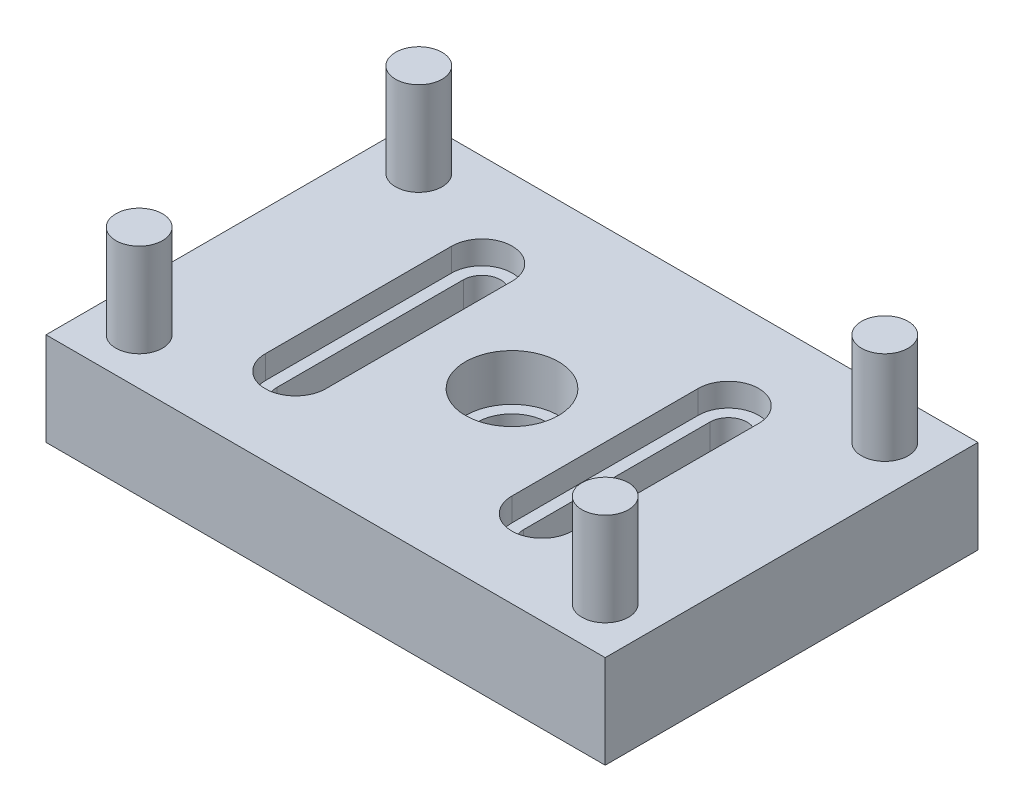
ISO-10303-21;
HEADER;
FILE_DESCRIPTION(('STEP AP214'),'2;1');
FILE_NAME('part.step','',(''),(''),'','','');
FILE_SCHEMA(('AUTOMOTIVE_DESIGN { 1 0 10303 214 1 1 1 1 }'));
ENDSEC;
DATA;
#1=APPLICATION_CONTEXT('core data for automotive mechanical design processes');
#2=APPLICATION_PROTOCOL_DEFINITION('international standard','automotive_design',2000,#1);
#3=PRODUCT_CONTEXT('',#1,'mechanical');
#4=PRODUCT('Part','Part','',(#3));
#5=PRODUCT_RELATED_PRODUCT_CATEGORY('part','',(#4));
#6=PRODUCT_DEFINITION_FORMATION('','',#4);
#7=PRODUCT_DEFINITION_CONTEXT('part definition',#1,'design');
#8=PRODUCT_DEFINITION('design','',#6,#7);
#9=PRODUCT_DEFINITION_SHAPE('','',#8);
#10=(LENGTH_UNIT() NAMED_UNIT(*) SI_UNIT(.MILLI.,.METRE.));
#11=(NAMED_UNIT(*) PLANE_ANGLE_UNIT() SI_UNIT($,.RADIAN.));
#12=(NAMED_UNIT(*) SI_UNIT($,.STERADIAN.) SOLID_ANGLE_UNIT());
#13=UNCERTAINTY_MEASURE_WITH_UNIT(LENGTH_MEASURE(1.E-05),#10,'distance_accuracy_value','');
#14=(GEOMETRIC_REPRESENTATION_CONTEXT(3) GLOBAL_UNCERTAINTY_ASSIGNED_CONTEXT((#13)) GLOBAL_UNIT_ASSIGNED_CONTEXT((#10,
#11,#12)) REPRESENTATION_CONTEXT('',''));
#15=CARTESIAN_POINT('',(0.,0.,0.));
#16=DIRECTION('',(0.,0.,1.));
#17=DIRECTION('',(1.,0.,0.));
#18=AXIS2_PLACEMENT_3D('',#15,#16,#17);
#19=CARTESIAN_POINT('',(0.,-25.4,0.));
#20=DIRECTION('',(0.,1.,0.));
#21=DIRECTION('',(0.,0.,1.));
#22=AXIS2_PLACEMENT_3D('',#19,#20,#21);
#23=CYLINDRICAL_SURFACE('',#22,9.525);
#24=CARTESIAN_POINT('',(0.,-25.4,0.));
#25=DIRECTION('',(0.,1.,0.));
#26=DIRECTION('',(0.,0.,1.));
#27=AXIS2_PLACEMENT_3D('',#24,#25,#26);
#28=CIRCLE('',#27,9.525);
#29=CARTESIAN_POINT('',(0.,-25.4,9.525));
#30=VERTEX_POINT('',#29);
#31=EDGE_CURVE('E408',#30,#30,#28,.T.);
#32=ORIENTED_EDGE('',*,*,#31,.F.);
#33=EDGE_LOOP('',(#32));
#34=FACE_BOUND('',#33,.T.);
#35=CARTESIAN_POINT('',(0.,-12.7,0.));
#36=DIRECTION('',(0.,1.,0.));
#37=DIRECTION('',(0.,0.,1.));
#38=AXIS2_PLACEMENT_3D('',#35,#36,#37);
#39=CIRCLE('',#38,9.525);
#40=CARTESIAN_POINT('',(0.,-12.7,9.525));
#41=VERTEX_POINT('',#40);
#42=EDGE_CURVE('E404',#41,#41,#39,.T.);
#43=ORIENTED_EDGE('',*,*,#42,.T.);
#44=EDGE_LOOP('',(#43));
#45=FACE_BOUND('',#44,.T.);
#46=ADVANCED_FACE('F33',(#34,#45),#23,.F.);
#47=CARTESIAN_POINT('',(0.,0.,0.));
#48=DIRECTION('',(0.,-1.,0.));
#49=DIRECTION('',(0.,0.,-1.));
#50=AXIS2_PLACEMENT_3D('',#47,#48,#49);
#51=PLANE('',#50);
#52=CARTESIAN_POINT('',(0.,0.,0.));
#53=DIRECTION('',(0.,1.,0.));
#54=DIRECTION('',(0.,0.,1.));
#55=AXIS2_PLACEMENT_3D('',#52,#53,#54);
#56=CIRCLE('',#55,12.7);
#57=CARTESIAN_POINT('',(0.,0.,12.7));
#58=VERTEX_POINT('',#57);
#59=EDGE_CURVE('E413',#58,#58,#56,.T.);
#60=ORIENTED_EDGE('',*,*,#59,.F.);
#61=EDGE_LOOP('',(#60));
#62=FACE_BOUND('',#61,.T.);
#63=CARTESIAN_POINT('',(-63.5,0.,38.1));
#64=DIRECTION('',(0.,-1.,0.));
#65=DIRECTION('',(0.,0.,-1.));
#66=AXIS2_PLACEMENT_3D('',#63,#64,#65);
#67=CIRCLE('',#66,6.35);
#68=CARTESIAN_POINT('',(-63.5,0.,31.75));
#69=VERTEX_POINT('',#68);
#70=EDGE_CURVE('E41',#69,#69,#67,.F.);
#71=ORIENTED_EDGE('',*,*,#70,.F.);
#72=EDGE_LOOP('',(#71));
#73=FACE_BOUND('',#72,.T.);
#74=CARTESIAN_POINT('',(63.5,0.,-38.1));
#75=DIRECTION('',(0.,-1.,0.));
#76=DIRECTION('',(0.,0.,-1.));
#77=AXIS2_PLACEMENT_3D('',#74,#75,#76);
#78=CIRCLE('',#77,6.35);
#79=CARTESIAN_POINT('',(63.5,0.,-44.45));
#80=VERTEX_POINT('',#79);
#81=EDGE_CURVE('E339',#80,#80,#78,.F.);
#82=ORIENTED_EDGE('',*,*,#81,.F.);
#83=EDGE_LOOP('',(#82));
#84=FACE_BOUND('',#83,.T.);
#85=DIRECTION('',(0.,0.,-1.));
#86=VECTOR('',#85,1.);
#87=CARTESIAN_POINT('',(-76.2,0.,50.8));
#88=LINE('',#87,#86);
#89=CARTESIAN_POINT('',(-76.2,0.,50.8));
#90=VERTEX_POINT('',#89);
#91=CARTESIAN_POINT('',(-76.2,0.,-50.8));
#92=VERTEX_POINT('',#91);
#93=EDGE_CURVE('E299',#90,#92,#88,.T.);
#94=ORIENTED_EDGE('',*,*,#93,.F.);
#95=DIRECTION('',(1.,0.,0.));
#96=VECTOR('',#95,1.);
#97=CARTESIAN_POINT('',(-76.2,0.,50.8));
#98=LINE('',#97,#96);
#99=CARTESIAN_POINT('',(76.2,0.,50.8));
#100=VERTEX_POINT('',#99);
#101=EDGE_CURVE('E312',#90,#100,#98,.T.);
#102=ORIENTED_EDGE('',*,*,#101,.T.);
#103=DIRECTION('',(0.,0.,-1.));
#104=VECTOR('',#103,1.);
#105=CARTESIAN_POINT('',(76.2,0.,50.8));
#106=LINE('',#105,#104);
#107=CARTESIAN_POINT('',(76.2,0.,-50.8));
#108=VERTEX_POINT('',#107);
#109=EDGE_CURVE('E326',#100,#108,#106,.T.);
#110=ORIENTED_EDGE('',*,*,#109,.T.);
#111=DIRECTION('',(1.,0.,0.));
#112=VECTOR('',#111,1.);
#113=CARTESIAN_POINT('',(-76.2,0.,-50.8));
#114=LINE('',#113,#112);
#115=EDGE_CURVE('E323',#92,#108,#114,.T.);
#116=ORIENTED_EDGE('',*,*,#115,.F.);
#117=EDGE_LOOP('',(#94,#102,#110,#116));
#118=FACE_BOUND('',#117,.T.);
#119=CARTESIAN_POINT('',(-33.5915,0.,25.4));
#120=DIRECTION('',(0.,1.,0.));
#121=DIRECTION('',(0.,0.,1.));
#122=AXIS2_PLACEMENT_3D('',#119,#120,#121);
#123=CIRCLE('',#122,8.25500000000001);
#124=CARTESIAN_POINT('',(-41.8465,0.,25.4));
#125=VERTEX_POINT('',#124);
#126=CARTESIAN_POINT('',(-25.3365,0.,25.4));
#127=VERTEX_POINT('',#126);
#128=EDGE_CURVE('E245',#125,#127,#123,.T.);
#129=ORIENTED_EDGE('',*,*,#128,.F.);
#130=DIRECTION('',(0.,0.,1.));
#131=VECTOR('',#130,1.);
#132=CARTESIAN_POINT('',(-41.8465,0.,0.));
#133=LINE('',#132,#131);
#134=CARTESIAN_POINT('',(-41.8465,0.,-25.4));
#135=VERTEX_POINT('',#134);
#136=EDGE_CURVE('E216',#135,#125,#133,.T.);
#137=ORIENTED_EDGE('',*,*,#136,.F.);
#138=CARTESIAN_POINT('',(-33.5915,0.,-25.4));
#139=DIRECTION('',(0.,1.,0.));
#140=DIRECTION('',(0.,0.,1.));
#141=AXIS2_PLACEMENT_3D('',#138,#139,#140);
#142=CIRCLE('',#141,8.25500000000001);
#143=CARTESIAN_POINT('',(-25.3365,0.,-25.4));
#144=VERTEX_POINT('',#143);
#145=EDGE_CURVE('E224',#144,#135,#142,.T.);
#146=ORIENTED_EDGE('',*,*,#145,.F.);
#147=DIRECTION('',(0.,0.,1.));
#148=VECTOR('',#147,1.);
#149=CARTESIAN_POINT('',(-25.3365,0.,0.));
#150=LINE('',#149,#148);
#151=EDGE_CURVE('E248',#144,#127,#150,.T.);
#152=ORIENTED_EDGE('',*,*,#151,.T.);
#153=EDGE_LOOP('',(#129,#137,#146,#152));
#154=FACE_BOUND('',#153,.T.);
#155=CARTESIAN_POINT('',(33.5915,0.,25.4));
#156=DIRECTION('',(0.,1.,0.));
#157=DIRECTION('',(0.,0.,1.));
#158=AXIS2_PLACEMENT_3D('',#155,#156,#157);
#159=CIRCLE('',#158,8.25500000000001);
#160=CARTESIAN_POINT('',(41.8465,0.,25.4));
#161=VERTEX_POINT('',#160);
#162=CARTESIAN_POINT('',(25.3365,0.,25.4));
#163=VERTEX_POINT('',#162);
#164=EDGE_CURVE('E48',#161,#163,#159,.F.);
#165=ORIENTED_EDGE('',*,*,#164,.T.);
#166=DIRECTION('',(0.,0.,1.));
#167=VECTOR('',#166,1.);
#168=CARTESIAN_POINT('',(25.3365,0.,0.));
#169=LINE('',#168,#167);
#170=CARTESIAN_POINT('',(25.3365,0.,-25.4));
#171=VERTEX_POINT('',#170);
#172=EDGE_CURVE('E190',#171,#163,#169,.T.);
#173=ORIENTED_EDGE('',*,*,#172,.F.);
#174=CARTESIAN_POINT('',(33.5915,0.,-25.4));
#175=DIRECTION('',(0.,1.,0.));
#176=DIRECTION('',(0.,0.,1.));
#177=AXIS2_PLACEMENT_3D('',#174,#175,#176);
#178=CIRCLE('',#177,8.25500000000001);
#179=CARTESIAN_POINT('',(41.8465,0.,-25.4));
#180=VERTEX_POINT('',#179);
#181=EDGE_CURVE('E193',#171,#180,#178,.F.);
#182=ORIENTED_EDGE('',*,*,#181,.T.);
#183=DIRECTION('',(0.,0.,1.));
#184=VECTOR('',#183,1.);
#185=CARTESIAN_POINT('',(41.8465,0.,0.));
#186=LINE('',#185,#184);
#187=EDGE_CURVE('E210',#180,#161,#186,.T.);
#188=ORIENTED_EDGE('',*,*,#187,.T.);
#189=EDGE_LOOP('',(#165,#173,#182,#188));
#190=FACE_BOUND('',#189,.T.);
#191=CARTESIAN_POINT('',(-63.5,0.,-38.1));
#192=DIRECTION('',(0.,-1.,0.));
#193=DIRECTION('',(0.,0.,-1.));
#194=AXIS2_PLACEMENT_3D('',#191,#192,#193);
#195=CIRCLE('',#194,6.35);
#196=CARTESIAN_POINT('',(-63.5,0.,-44.45));
#197=VERTEX_POINT('',#196);
#198=EDGE_CURVE('E342',#197,#197,#195,.F.);
#199=ORIENTED_EDGE('',*,*,#198,.F.);
#200=EDGE_LOOP('',(#199));
#201=FACE_BOUND('',#200,.T.);
#202=CARTESIAN_POINT('',(63.5,0.,38.1));
#203=DIRECTION('',(0.,-1.,0.));
#204=DIRECTION('',(0.,0.,-1.));
#205=AXIS2_PLACEMENT_3D('',#202,#203,#204);
#206=CIRCLE('',#205,6.35);
#207=CARTESIAN_POINT('',(63.5,0.,31.75));
#208=VERTEX_POINT('',#207);
#209=EDGE_CURVE('E11',#208,#208,#206,.F.);
#210=ORIENTED_EDGE('',*,*,#209,.F.);
#211=EDGE_LOOP('',(#210));
#212=FACE_BOUND('',#211,.T.);
#213=ADVANCED_FACE('F349',(#62,#73,#84,#118,#154,#190,#201,#212),#51,.F.);
#214=CARTESIAN_POINT('',(33.5915,-25.4,-25.4));
#215=DIRECTION('',(0.,1.,0.));
#216=DIRECTION('',(0.,0.,1.));
#217=AXIS2_PLACEMENT_3D('',#214,#215,#216);
#218=CYLINDRICAL_SURFACE('',#217,5.08);
#219=DIRECTION('',(0.,1.,0.));
#220=VECTOR('',#219,1.);
#221=CARTESIAN_POINT('',(38.6715,-25.4,-25.4));
#222=LINE('',#221,#220);
#223=CARTESIAN_POINT('',(38.6715,-25.4,-25.4));
#224=VERTEX_POINT('',#223);
#225=CARTESIAN_POINT('',(38.6715,-6.35,-25.4));
#226=VERTEX_POINT('',#225);
#227=EDGE_CURVE('E272',#224,#226,#222,.T.);
#228=ORIENTED_EDGE('',*,*,#227,.T.);
#229=CARTESIAN_POINT('',(33.5915,-6.35,-25.4));
#230=DIRECTION('',(0.,1.,0.));
#231=DIRECTION('',(0.,0.,1.));
#232=AXIS2_PLACEMENT_3D('',#229,#230,#231);
#233=CIRCLE('',#232,5.08);
#234=CARTESIAN_POINT('',(28.5115,-6.35,-25.4));
#235=VERTEX_POINT('',#234);
#236=EDGE_CURVE('E203',#235,#226,#233,.F.);
#237=ORIENTED_EDGE('',*,*,#236,.F.);
#238=DIRECTION('',(0.,1.,0.));
#239=VECTOR('',#238,1.);
#240=CARTESIAN_POINT('',(28.5115,-25.4,-25.4));
#241=LINE('',#240,#239);
#242=CARTESIAN_POINT('',(28.5115,-25.4,-25.4));
#243=VERTEX_POINT('',#242);
#244=EDGE_CURVE('E271',#243,#235,#241,.T.);
#245=ORIENTED_EDGE('',*,*,#244,.F.);
#246=CARTESIAN_POINT('',(33.5915,-25.4,-25.4));
#247=DIRECTION('',(0.,1.,0.));
#248=DIRECTION('',(0.,0.,1.));
#249=AXIS2_PLACEMENT_3D('',#246,#247,#248);
#250=CIRCLE('',#249,5.08);
#251=EDGE_CURVE('E255',#243,#224,#250,.F.);
#252=ORIENTED_EDGE('',*,*,#251,.T.);
#253=EDGE_LOOP('',(#228,#237,#245,#252));
#254=FACE_BOUND('',#253,.T.);
#255=ADVANCED_FACE('F352',(#254),#218,.F.);
#256=CARTESIAN_POINT('',(38.6715,-25.4,0.));
#257=DIRECTION('',(1.,0.,0.));
#258=DIRECTION('',(0.,0.,-1.));
#259=AXIS2_PLACEMENT_3D('',#256,#257,#258);
#260=PLANE('',#259);
#261=DIRECTION('',(0.,0.,-1.));
#262=VECTOR('',#261,1.);
#263=CARTESIAN_POINT('',(38.6715,-6.35,0.));
#264=LINE('',#263,#262);
#265=CARTESIAN_POINT('',(38.6715,-6.35,25.4));
#266=VERTEX_POINT('',#265);
#267=EDGE_CURVE('E205',#266,#226,#264,.T.);
#268=ORIENTED_EDGE('',*,*,#267,.T.);
#269=ORIENTED_EDGE('',*,*,#227,.F.);
#270=DIRECTION('',(0.,0.,-1.));
#271=VECTOR('',#270,1.);
#272=CARTESIAN_POINT('',(38.6715,-25.4,0.));
#273=LINE('',#272,#271);
#274=CARTESIAN_POINT('',(38.6715,-25.4,25.4));
#275=VERTEX_POINT('',#274);
#276=EDGE_CURVE('E268',#275,#224,#273,.T.);
#277=ORIENTED_EDGE('',*,*,#276,.F.);
#278=DIRECTION('',(0.,1.,0.));
#279=VECTOR('',#278,1.);
#280=CARTESIAN_POINT('',(38.6715,-25.4,25.4));
#281=LINE('',#280,#279);
#282=EDGE_CURVE('E276',#275,#266,#281,.T.);
#283=ORIENTED_EDGE('',*,*,#282,.T.);
#284=EDGE_LOOP('',(#268,#269,#277,#283));
#285=FACE_BOUND('',#284,.T.);
#286=ADVANCED_FACE('F477',(#285),#260,.F.);
#287=CARTESIAN_POINT('',(33.5915,-25.4,25.4));
#288=DIRECTION('',(0.,1.,0.));
#289=DIRECTION('',(0.,0.,1.));
#290=AXIS2_PLACEMENT_3D('',#287,#288,#289);
#291=CYLINDRICAL_SURFACE('',#290,5.08);
#292=DIRECTION('',(0.,1.,0.));
#293=VECTOR('',#292,1.);
#294=CARTESIAN_POINT('',(28.5115,-25.4,25.4));
#295=LINE('',#294,#293);
#296=CARTESIAN_POINT('',(28.5115,-25.4,25.4));
#297=VERTEX_POINT('',#296);
#298=CARTESIAN_POINT('',(28.5115,-6.35,25.4));
#299=VERTEX_POINT('',#298);
#300=EDGE_CURVE('E279',#297,#299,#295,.T.);
#301=ORIENTED_EDGE('',*,*,#300,.T.);
#302=CARTESIAN_POINT('',(33.5915,-6.35,25.4));
#303=DIRECTION('',(0.,1.,0.));
#304=DIRECTION('',(0.,0.,1.));
#305=AXIS2_PLACEMENT_3D('',#302,#303,#304);
#306=CIRCLE('',#305,5.08);
#307=EDGE_CURVE('E56',#266,#299,#306,.F.);
#308=ORIENTED_EDGE('',*,*,#307,.F.);
#309=ORIENTED_EDGE('',*,*,#282,.F.);
#310=CARTESIAN_POINT('',(33.5915,-25.4,25.4));
#311=DIRECTION('',(0.,1.,0.));
#312=DIRECTION('',(0.,0.,1.));
#313=AXIS2_PLACEMENT_3D('',#310,#311,#312);
#314=CIRCLE('',#313,5.08);
#315=EDGE_CURVE('E265',#275,#297,#314,.F.);
#316=ORIENTED_EDGE('',*,*,#315,.T.);
#317=EDGE_LOOP('',(#301,#308,#309,#316));
#318=FACE_BOUND('',#317,.T.);
#319=ADVANCED_FACE('F480',(#318),#291,.F.);
#320=CARTESIAN_POINT('',(28.5115,-25.4,0.));
#321=DIRECTION('',(1.,0.,0.));
#322=DIRECTION('',(0.,0.,-1.));
#323=AXIS2_PLACEMENT_3D('',#320,#321,#322);
#324=PLANE('',#323);
#325=ORIENTED_EDGE('',*,*,#244,.T.);
#326=DIRECTION('',(0.,0.,-1.));
#327=VECTOR('',#326,1.);
#328=CARTESIAN_POINT('',(28.5115,-6.35,0.));
#329=LINE('',#328,#327);
#330=EDGE_CURVE('E201',#299,#235,#329,.T.);
#331=ORIENTED_EDGE('',*,*,#330,.F.);
#332=ORIENTED_EDGE('',*,*,#300,.F.);
#333=DIRECTION('',(0.,0.,-1.));
#334=VECTOR('',#333,1.);
#335=CARTESIAN_POINT('',(28.5115,-25.4,0.));
#336=LINE('',#335,#334);
#337=EDGE_CURVE('E263',#297,#243,#336,.T.);
#338=ORIENTED_EDGE('',*,*,#337,.T.);
#339=EDGE_LOOP('',(#325,#331,#332,#338));
#340=FACE_BOUND('',#339,.T.);
#341=ADVANCED_FACE('F484',(#340),#324,.T.);
#342=CARTESIAN_POINT('',(-28.5115,-25.4,0.));
#343=DIRECTION('',(1.,0.,0.));
#344=DIRECTION('',(0.,0.,-1.));
#345=AXIS2_PLACEMENT_3D('',#342,#343,#344);
#346=PLANE('',#345);
#347=DIRECTION('',(0.,0.,-1.));
#348=VECTOR('',#347,1.);
#349=CARTESIAN_POINT('',(-28.5115,-6.35,0.));
#350=LINE('',#349,#348);
#351=CARTESIAN_POINT('',(-28.5115,-6.35,25.4));
#352=VERTEX_POINT('',#351);
#353=CARTESIAN_POINT('',(-28.5115,-6.35,-25.4));
#354=VERTEX_POINT('',#353);
#355=EDGE_CURVE('E223',#352,#354,#350,.T.);
#356=ORIENTED_EDGE('',*,*,#355,.T.);
#357=DIRECTION('',(0.,1.,0.));
#358=VECTOR('',#357,1.);
#359=CARTESIAN_POINT('',(-28.5115,-25.4,-25.4));
#360=LINE('',#359,#358);
#361=CARTESIAN_POINT('',(-28.5115,-25.4,-25.4));
#362=VERTEX_POINT('',#361);
#363=EDGE_CURVE('E295',#362,#354,#360,.T.);
#364=ORIENTED_EDGE('',*,*,#363,.F.);
#365=DIRECTION('',(0.,0.,-1.));
#366=VECTOR('',#365,1.);
#367=CARTESIAN_POINT('',(-28.5115,-25.4,0.));
#368=LINE('',#367,#366);
#369=CARTESIAN_POINT('',(-28.5115,-25.4,25.4));
#370=VERTEX_POINT('',#369);
#371=EDGE_CURVE('E275',#370,#362,#368,.T.);
#372=ORIENTED_EDGE('',*,*,#371,.F.);
#373=DIRECTION('',(0.,1.,0.));
#374=VECTOR('',#373,1.);
#375=CARTESIAN_POINT('',(-28.5115,-25.4,25.4));
#376=LINE('',#375,#374);
#377=EDGE_CURVE('E296',#370,#352,#376,.T.);
#378=ORIENTED_EDGE('',*,*,#377,.T.);
#379=EDGE_LOOP('',(#356,#364,#372,#378));
#380=FACE_BOUND('',#379,.T.);
#381=ADVANCED_FACE('F488',(#380),#346,.F.);
#382=CARTESIAN_POINT('',(-33.5915,-25.4,25.4));
#383=DIRECTION('',(0.,1.,0.));
#384=DIRECTION('',(0.,0.,1.));
#385=AXIS2_PLACEMENT_3D('',#382,#383,#384);
#386=CYLINDRICAL_SURFACE('',#385,5.08);
#387=CARTESIAN_POINT('',(-33.5915,-6.35,25.4));
#388=DIRECTION('',(0.,1.,0.));
#389=DIRECTION('',(0.,0.,1.));
#390=AXIS2_PLACEMENT_3D('',#387,#388,#389);
#391=CIRCLE('',#390,5.08);
#392=CARTESIAN_POINT('',(-38.6715,-6.35,25.4));
#393=VERTEX_POINT('',#392);
#394=EDGE_CURVE('E227',#393,#352,#391,.T.);
#395=ORIENTED_EDGE('',*,*,#394,.T.);
#396=ORIENTED_EDGE('',*,*,#377,.F.);
#397=CARTESIAN_POINT('',(-33.5915,-25.4,25.4));
#398=DIRECTION('',(0.,1.,0.));
#399=DIRECTION('',(0.,0.,1.));
#400=AXIS2_PLACEMENT_3D('',#397,#398,#399);
#401=CIRCLE('',#400,5.08);
#402=CARTESIAN_POINT('',(-38.6715,-25.4,25.4));
#403=VERTEX_POINT('',#402);
#404=EDGE_CURVE('E292',#403,#370,#401,.T.);
#405=ORIENTED_EDGE('',*,*,#404,.F.);
#406=DIRECTION('',(0.,1.,0.));
#407=VECTOR('',#406,1.);
#408=CARTESIAN_POINT('',(-38.6715,-25.4,25.4));
#409=LINE('',#408,#407);
#410=EDGE_CURVE('E300',#403,#393,#409,.T.);
#411=ORIENTED_EDGE('',*,*,#410,.T.);
#412=EDGE_LOOP('',(#395,#396,#405,#411));
#413=FACE_BOUND('',#412,.T.);
#414=ADVANCED_FACE('F493',(#413),#386,.F.);
#415=CARTESIAN_POINT('',(-38.6715,-25.4,0.));
#416=DIRECTION('',(1.,0.,0.));
#417=DIRECTION('',(0.,0.,-1.));
#418=AXIS2_PLACEMENT_3D('',#415,#416,#417);
#419=PLANE('',#418);
#420=DIRECTION('',(0.,1.,0.));
#421=VECTOR('',#420,1.);
#422=CARTESIAN_POINT('',(-38.6715,-25.4,-25.4));
#423=LINE('',#422,#421);
#424=CARTESIAN_POINT('',(-38.6715,-25.4,-25.4));
#425=VERTEX_POINT('',#424);
#426=CARTESIAN_POINT('',(-38.6715,-6.35,-25.4));
#427=VERTEX_POINT('',#426);
#428=EDGE_CURVE('E303',#425,#427,#423,.T.);
#429=ORIENTED_EDGE('',*,*,#428,.T.);
#430=DIRECTION('',(0.,0.,-1.));
#431=VECTOR('',#430,1.);
#432=CARTESIAN_POINT('',(-38.6715,-6.35,0.));
#433=LINE('',#432,#431);
#434=EDGE_CURVE('E230',#393,#427,#433,.T.);
#435=ORIENTED_EDGE('',*,*,#434,.F.);
#436=ORIENTED_EDGE('',*,*,#410,.F.);
#437=DIRECTION('',(0.,0.,-1.));
#438=VECTOR('',#437,1.);
#439=CARTESIAN_POINT('',(-38.6715,-25.4,0.));
#440=LINE('',#439,#438);
#441=EDGE_CURVE('E289',#403,#425,#440,.T.);
#442=ORIENTED_EDGE('',*,*,#441,.T.);
#443=EDGE_LOOP('',(#429,#435,#436,#442));
#444=FACE_BOUND('',#443,.T.);
#445=ADVANCED_FACE('F496',(#444),#419,.T.);
#446=CARTESIAN_POINT('',(-33.5915,-25.4,-25.4));
#447=DIRECTION('',(0.,1.,0.));
#448=DIRECTION('',(0.,0.,1.));
#449=AXIS2_PLACEMENT_3D('',#446,#447,#448);
#450=CYLINDRICAL_SURFACE('',#449,5.08);
#451=CARTESIAN_POINT('',(-33.5915,-6.35,-25.4));
#452=DIRECTION('',(0.,1.,0.));
#453=DIRECTION('',(0.,0.,1.));
#454=AXIS2_PLACEMENT_3D('',#451,#452,#453);
#455=CIRCLE('',#454,5.08);
#456=EDGE_CURVE('E220',#354,#427,#455,.T.);
#457=ORIENTED_EDGE('',*,*,#456,.T.);
#458=ORIENTED_EDGE('',*,*,#428,.F.);
#459=CARTESIAN_POINT('',(-33.5915,-25.4,-25.4));
#460=DIRECTION('',(0.,1.,0.));
#461=DIRECTION('',(0.,0.,1.));
#462=AXIS2_PLACEMENT_3D('',#459,#460,#461);
#463=CIRCLE('',#462,5.08);
#464=EDGE_CURVE('E286',#362,#425,#463,.T.);
#465=ORIENTED_EDGE('',*,*,#464,.F.);
#466=ORIENTED_EDGE('',*,*,#363,.T.);
#467=EDGE_LOOP('',(#457,#458,#465,#466));
#468=FACE_BOUND('',#467,.T.);
#469=ADVANCED_FACE('F500',(#468),#450,.F.);
#470=CARTESIAN_POINT('',(0.,-25.4,0.));
#471=DIRECTION('',(0.,-1.,0.));
#472=DIRECTION('',(0.,0.,-1.));
#473=AXIS2_PLACEMENT_3D('',#470,#471,#472);
#474=PLANE('',#473);
#475=ORIENTED_EDGE('',*,*,#31,.T.);
#476=EDGE_LOOP('',(#475));
#477=FACE_BOUND('',#476,.T.);
#478=DIRECTION('',(0.,0.,-1.));
#479=VECTOR('',#478,1.);
#480=CARTESIAN_POINT('',(-76.2,-25.4,50.8));
#481=LINE('',#480,#479);
#482=CARTESIAN_POINT('',(-76.2,-25.4,50.8));
#483=VERTEX_POINT('',#482);
#484=CARTESIAN_POINT('',(-76.2,-25.4,-50.8));
#485=VERTEX_POINT('',#484);
#486=EDGE_CURVE('E308',#483,#485,#481,.T.);
#487=ORIENTED_EDGE('',*,*,#486,.T.);
#488=DIRECTION('',(1.,0.,0.));
#489=VECTOR('',#488,1.);
#490=CARTESIAN_POINT('',(-76.2,-25.4,-50.8));
#491=LINE('',#490,#489);
#492=CARTESIAN_POINT('',(76.2,-25.4,-50.8));
#493=VERTEX_POINT('',#492);
#494=EDGE_CURVE('E311',#485,#493,#491,.T.);
#495=ORIENTED_EDGE('',*,*,#494,.T.);
#496=DIRECTION('',(0.,0.,-1.));
#497=VECTOR('',#496,1.);
#498=CARTESIAN_POINT('',(76.2,-25.4,50.8));
#499=LINE('',#498,#497);
#500=CARTESIAN_POINT('',(76.2,-25.4,50.8));
#501=VERTEX_POINT('',#500);
#502=EDGE_CURVE('E314',#501,#493,#499,.T.);
#503=ORIENTED_EDGE('',*,*,#502,.F.);
#504=DIRECTION('',(1.,0.,0.));
#505=VECTOR('',#504,1.);
#506=CARTESIAN_POINT('',(-76.2,-25.4,50.8));
#507=LINE('',#506,#505);
#508=EDGE_CURVE('E317',#483,#501,#507,.T.);
#509=ORIENTED_EDGE('',*,*,#508,.F.);
#510=EDGE_LOOP('',(#487,#495,#503,#509));
#511=FACE_BOUND('',#510,.T.);
#512=ORIENTED_EDGE('',*,*,#371,.T.);
#513=ORIENTED_EDGE('',*,*,#464,.T.);
#514=ORIENTED_EDGE('',*,*,#441,.F.);
#515=ORIENTED_EDGE('',*,*,#404,.T.);
#516=EDGE_LOOP('',(#512,#513,#514,#515));
#517=FACE_BOUND('',#516,.T.);
#518=ORIENTED_EDGE('',*,*,#276,.T.);
#519=ORIENTED_EDGE('',*,*,#251,.F.);
#520=ORIENTED_EDGE('',*,*,#337,.F.);
#521=ORIENTED_EDGE('',*,*,#315,.F.);
#522=EDGE_LOOP('',(#518,#519,#520,#521));
#523=FACE_BOUND('',#522,.T.);
#524=ADVANCED_FACE('F504',(#477,#511,#517,#523),#474,.T.);
#525=CARTESIAN_POINT('',(-76.2,-25.4,50.8));
#526=DIRECTION('',(1.,0.,0.));
#527=DIRECTION('',(0.,0.,-1.));
#528=AXIS2_PLACEMENT_3D('',#525,#526,#527);
#529=PLANE('',#528);
#530=ORIENTED_EDGE('',*,*,#93,.T.);
#531=DIRECTION('',(0.,1.,0.));
#532=VECTOR('',#531,1.);
#533=CARTESIAN_POINT('',(-76.2,-25.4,-50.8));
#534=LINE('',#533,#532);
#535=EDGE_CURVE('E336',#485,#92,#534,.T.);
#536=ORIENTED_EDGE('',*,*,#535,.F.);
#537=ORIENTED_EDGE('',*,*,#486,.F.);
#538=DIRECTION('',(0.,1.,0.));
#539=VECTOR('',#538,1.);
#540=CARTESIAN_POINT('',(-76.2,-25.4,50.8));
#541=LINE('',#540,#539);
#542=EDGE_CURVE('E320',#483,#90,#541,.T.);
#543=ORIENTED_EDGE('',*,*,#542,.T.);
#544=EDGE_LOOP('',(#530,#536,#537,#543));
#545=FACE_BOUND('',#544,.T.);
#546=ADVANCED_FACE('F35',(#545),#529,.F.);
#547=CARTESIAN_POINT('',(-76.2,-25.4,-50.8));
#548=DIRECTION('',(0.,0.,1.));
#549=DIRECTION('',(1.,0.,0.));
#550=AXIS2_PLACEMENT_3D('',#547,#548,#549);
#551=PLANE('',#550);
#552=ORIENTED_EDGE('',*,*,#115,.T.);
#553=DIRECTION('',(0.,1.,0.));
#554=VECTOR('',#553,1.);
#555=CARTESIAN_POINT('',(76.2,-25.4,-50.8));
#556=LINE('',#555,#554);
#557=EDGE_CURVE('E334',#493,#108,#556,.T.);
#558=ORIENTED_EDGE('',*,*,#557,.F.);
#559=ORIENTED_EDGE('',*,*,#494,.F.);
#560=ORIENTED_EDGE('',*,*,#535,.T.);
#561=EDGE_LOOP('',(#552,#558,#559,#560));
#562=FACE_BOUND('',#561,.T.);
#563=ADVANCED_FACE('F517',(#562),#551,.F.);
#564=CARTESIAN_POINT('',(76.2,-25.4,50.8));
#565=DIRECTION('',(1.,0.,0.));
#566=DIRECTION('',(0.,0.,-1.));
#567=AXIS2_PLACEMENT_3D('',#564,#565,#566);
#568=PLANE('',#567);
#569=ORIENTED_EDGE('',*,*,#109,.F.);
#570=DIRECTION('',(0.,1.,0.));
#571=VECTOR('',#570,1.);
#572=CARTESIAN_POINT('',(76.2,-25.4,50.8));
#573=LINE('',#572,#571);
#574=EDGE_CURVE('E332',#501,#100,#573,.T.);
#575=ORIENTED_EDGE('',*,*,#574,.F.);
#576=ORIENTED_EDGE('',*,*,#502,.T.);
#577=ORIENTED_EDGE('',*,*,#557,.T.);
#578=EDGE_LOOP('',(#569,#575,#576,#577));
#579=FACE_BOUND('',#578,.T.);
#580=ADVANCED_FACE('F514',(#579),#568,.T.);
#581=CARTESIAN_POINT('',(-76.2,-25.4,50.8));
#582=DIRECTION('',(0.,0.,1.));
#583=DIRECTION('',(1.,0.,0.));
#584=AXIS2_PLACEMENT_3D('',#581,#582,#583);
#585=PLANE('',#584);
#586=ORIENTED_EDGE('',*,*,#101,.F.);
#587=ORIENTED_EDGE('',*,*,#542,.F.);
#588=ORIENTED_EDGE('',*,*,#508,.T.);
#589=ORIENTED_EDGE('',*,*,#574,.T.);
#590=EDGE_LOOP('',(#586,#587,#588,#589));
#591=FACE_BOUND('',#590,.T.);
#592=ADVANCED_FACE('F475',(#591),#585,.T.);
#593=CARTESIAN_POINT('',(-41.8465,-6.35,0.));
#594=DIRECTION('',(-1.,0.,0.));
#595=DIRECTION('',(0.,0.,1.));
#596=AXIS2_PLACEMENT_3D('',#593,#594,#595);
#597=PLANE('',#596);
#598=ORIENTED_EDGE('',*,*,#136,.T.);
#599=DIRECTION('',(0.,1.,0.));
#600=VECTOR('',#599,1.);
#601=CARTESIAN_POINT('',(-41.8465,-6.35,25.4));
#602=LINE('',#601,#600);
#603=CARTESIAN_POINT('',(-41.8465,-6.35,25.4));
#604=VERTEX_POINT('',#603);
#605=EDGE_CURVE('E243',#604,#125,#602,.T.);
#606=ORIENTED_EDGE('',*,*,#605,.F.);
#607=DIRECTION('',(0.,0.,1.));
#608=VECTOR('',#607,1.);
#609=CARTESIAN_POINT('',(-41.8465,-6.35,0.));
#610=LINE('',#609,#608);
#611=CARTESIAN_POINT('',(-41.8465,-6.35,-25.4));
#612=VERTEX_POINT('',#611);
#613=EDGE_CURVE('E232',#612,#604,#610,.T.);
#614=ORIENTED_EDGE('',*,*,#613,.F.);
#615=DIRECTION('',(0.,1.,0.));
#616=VECTOR('',#615,1.);
#617=CARTESIAN_POINT('',(-41.8465,-6.35,-25.4));
#618=LINE('',#617,#616);
#619=EDGE_CURVE('E253',#612,#135,#618,.T.);
#620=ORIENTED_EDGE('',*,*,#619,.T.);
#621=EDGE_LOOP('',(#598,#606,#614,#620));
#622=FACE_BOUND('',#621,.T.);
#623=ADVANCED_FACE('F465',(#622),#597,.F.);
#624=CARTESIAN_POINT('',(-33.5915,-6.35,-25.4));
#625=DIRECTION('',(0.,1.,0.));
#626=DIRECTION('',(0.,0.,1.));
#627=AXIS2_PLACEMENT_3D('',#624,#625,#626);
#628=CYLINDRICAL_SURFACE('',#627,8.25500000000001);
#629=ORIENTED_EDGE('',*,*,#145,.T.);
#630=ORIENTED_EDGE('',*,*,#619,.F.);
#631=CARTESIAN_POINT('',(-33.5915,-6.35,-25.4));
#632=DIRECTION('',(0.,1.,0.));
#633=DIRECTION('',(0.,0.,1.));
#634=AXIS2_PLACEMENT_3D('',#631,#632,#633);
#635=CIRCLE('',#634,8.25500000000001);
#636=CARTESIAN_POINT('',(-25.3365,-6.35,-25.4));
#637=VERTEX_POINT('',#636);
#638=EDGE_CURVE('E240',#637,#612,#635,.T.);
#639=ORIENTED_EDGE('',*,*,#638,.F.);
#640=DIRECTION('',(0.,1.,0.));
#641=VECTOR('',#640,1.);
#642=CARTESIAN_POINT('',(-25.3365,-6.35,-25.4));
#643=LINE('',#642,#641);
#644=EDGE_CURVE('E256',#637,#144,#643,.T.);
#645=ORIENTED_EDGE('',*,*,#644,.T.);
#646=EDGE_LOOP('',(#629,#630,#639,#645));
#647=FACE_BOUND('',#646,.T.);
#648=ADVANCED_FACE('F461',(#647),#628,.F.);
#649=CARTESIAN_POINT('',(-25.3365,-6.35,0.));
#650=DIRECTION('',(-1.,0.,0.));
#651=DIRECTION('',(0.,0.,1.));
#652=AXIS2_PLACEMENT_3D('',#649,#650,#651);
#653=PLANE('',#652);
#654=ORIENTED_EDGE('',*,*,#151,.F.);
#655=ORIENTED_EDGE('',*,*,#644,.F.);
#656=DIRECTION('',(0.,0.,1.));
#657=VECTOR('',#656,1.);
#658=CARTESIAN_POINT('',(-25.3365,-6.35,0.));
#659=LINE('',#658,#657);
#660=CARTESIAN_POINT('',(-25.3365,-6.35,25.4));
#661=VERTEX_POINT('',#660);
#662=EDGE_CURVE('E238',#637,#661,#659,.T.);
#663=ORIENTED_EDGE('',*,*,#662,.T.);
#664=DIRECTION('',(0.,1.,0.));
#665=VECTOR('',#664,1.);
#666=CARTESIAN_POINT('',(-25.3365,-6.35,25.4));
#667=LINE('',#666,#665);
#668=EDGE_CURVE('E258',#661,#127,#667,.T.);
#669=ORIENTED_EDGE('',*,*,#668,.T.);
#670=EDGE_LOOP('',(#654,#655,#663,#669));
#671=FACE_BOUND('',#670,.T.);
#672=ADVANCED_FACE('F464',(#671),#653,.T.);
#673=CARTESIAN_POINT('',(-33.5915,-6.35,25.4));
#674=DIRECTION('',(0.,1.,0.));
#675=DIRECTION('',(0.,0.,1.));
#676=AXIS2_PLACEMENT_3D('',#673,#674,#675);
#677=CYLINDRICAL_SURFACE('',#676,8.25500000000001);
#678=ORIENTED_EDGE('',*,*,#128,.T.);
#679=ORIENTED_EDGE('',*,*,#668,.F.);
#680=CARTESIAN_POINT('',(-33.5915,-6.35,25.4));
#681=DIRECTION('',(0.,1.,0.));
#682=DIRECTION('',(0.,0.,1.));
#683=AXIS2_PLACEMENT_3D('',#680,#681,#682);
#684=CIRCLE('',#683,8.25500000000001);
#685=EDGE_CURVE('E235',#604,#661,#684,.T.);
#686=ORIENTED_EDGE('',*,*,#685,.F.);
#687=ORIENTED_EDGE('',*,*,#605,.T.);
#688=EDGE_LOOP('',(#678,#679,#686,#687));
#689=FACE_BOUND('',#688,.T.);
#690=ADVANCED_FACE('F459',(#689),#677,.F.);
#691=CARTESIAN_POINT('',(0.,-6.35,0.));
#692=DIRECTION('',(0.,1.,0.));
#693=DIRECTION('',(0.,0.,1.));
#694=AXIS2_PLACEMENT_3D('',#691,#692,#693);
#695=PLANE('',#694);
#696=ORIENTED_EDGE('',*,*,#456,.F.);
#697=ORIENTED_EDGE('',*,*,#355,.F.);
#698=ORIENTED_EDGE('',*,*,#394,.F.);
#699=ORIENTED_EDGE('',*,*,#434,.T.);
#700=EDGE_LOOP('',(#696,#697,#698,#699));
#701=FACE_BOUND('',#700,.T.);
#702=ORIENTED_EDGE('',*,*,#613,.T.);
#703=ORIENTED_EDGE('',*,*,#685,.T.);
#704=ORIENTED_EDGE('',*,*,#662,.F.);
#705=ORIENTED_EDGE('',*,*,#638,.T.);
#706=EDGE_LOOP('',(#702,#703,#704,#705));
#707=FACE_BOUND('',#706,.T.);
#708=ADVANCED_FACE('F456',(#701,#707),#695,.T.);
#709=CARTESIAN_POINT('',(33.5915,-6.35,25.4));
#710=DIRECTION('',(0.,1.,0.));
#711=DIRECTION('',(0.,0.,1.));
#712=AXIS2_PLACEMENT_3D('',#709,#710,#711);
#713=CYLINDRICAL_SURFACE('',#712,8.25500000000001);
#714=ORIENTED_EDGE('',*,*,#164,.F.);
#715=DIRECTION('',(0.,1.,0.));
#716=VECTOR('',#715,1.);
#717=CARTESIAN_POINT('',(41.8465,-6.35,25.4));
#718=LINE('',#717,#716);
#719=CARTESIAN_POINT('',(41.8465,-6.35,25.4));
#720=VERTEX_POINT('',#719);
#721=EDGE_CURVE('E174',#720,#161,#718,.T.);
#722=ORIENTED_EDGE('',*,*,#721,.F.);
#723=CARTESIAN_POINT('',(33.5915,-6.35,25.4));
#724=DIRECTION('',(0.,1.,0.));
#725=DIRECTION('',(0.,0.,1.));
#726=AXIS2_PLACEMENT_3D('',#723,#724,#725);
#727=CIRCLE('',#726,8.25500000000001);
#728=CARTESIAN_POINT('',(25.3365,-6.35,25.4));
#729=VERTEX_POINT('',#728);
#730=EDGE_CURVE('E181',#720,#729,#727,.F.);
#731=ORIENTED_EDGE('',*,*,#730,.T.);
#732=DIRECTION('',(0.,1.,0.));
#733=VECTOR('',#732,1.);
#734=CARTESIAN_POINT('',(25.3365,-6.35,25.4));
#735=LINE('',#734,#733);
#736=EDGE_CURVE('E214',#729,#163,#735,.T.);
#737=ORIENTED_EDGE('',*,*,#736,.T.);
#738=EDGE_LOOP('',(#714,#722,#731,#737));
#739=FACE_BOUND('',#738,.T.);
#740=ADVANCED_FACE('F183',(#739),#713,.F.);
#741=CARTESIAN_POINT('',(25.3365,-6.35,0.));
#742=DIRECTION('',(-1.,0.,0.));
#743=DIRECTION('',(0.,0.,1.));
#744=AXIS2_PLACEMENT_3D('',#741,#742,#743);
#745=PLANE('',#744);
#746=ORIENTED_EDGE('',*,*,#172,.T.);
#747=ORIENTED_EDGE('',*,*,#736,.F.);
#748=DIRECTION('',(0.,0.,1.));
#749=VECTOR('',#748,1.);
#750=CARTESIAN_POINT('',(25.3365,-6.35,0.));
#751=LINE('',#750,#749);
#752=CARTESIAN_POINT('',(25.3365,-6.35,-25.4));
#753=VERTEX_POINT('',#752);
#754=EDGE_CURVE('E189',#753,#729,#751,.T.);
#755=ORIENTED_EDGE('',*,*,#754,.F.);
#756=DIRECTION('',(0.,1.,0.));
#757=VECTOR('',#756,1.);
#758=CARTESIAN_POINT('',(25.3365,-6.35,-25.4));
#759=LINE('',#758,#757);
#760=EDGE_CURVE('E217',#753,#171,#759,.T.);
#761=ORIENTED_EDGE('',*,*,#760,.T.);
#762=EDGE_LOOP('',(#746,#747,#755,#761));
#763=FACE_BOUND('',#762,.T.);
#764=ADVANCED_FACE('F444',(#763),#745,.F.);
#765=CARTESIAN_POINT('',(33.5915,-6.35,-25.4));
#766=DIRECTION('',(0.,1.,0.));
#767=DIRECTION('',(0.,0.,1.));
#768=AXIS2_PLACEMENT_3D('',#765,#766,#767);
#769=CYLINDRICAL_SURFACE('',#768,8.25500000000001);
#770=ORIENTED_EDGE('',*,*,#181,.F.);
#771=ORIENTED_EDGE('',*,*,#760,.F.);
#772=CARTESIAN_POINT('',(33.5915,-6.35,-25.4));
#773=DIRECTION('',(0.,1.,0.));
#774=DIRECTION('',(0.,0.,1.));
#775=AXIS2_PLACEMENT_3D('',#772,#773,#774);
#776=CIRCLE('',#775,8.25500000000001);
#777=CARTESIAN_POINT('',(41.8465,-6.35,-25.4));
#778=VERTEX_POINT('',#777);
#779=EDGE_CURVE('E180',#753,#778,#776,.F.);
#780=ORIENTED_EDGE('',*,*,#779,.T.);
#781=DIRECTION('',(0.,1.,0.));
#782=VECTOR('',#781,1.);
#783=CARTESIAN_POINT('',(41.8465,-6.35,-25.4));
#784=LINE('',#783,#782);
#785=EDGE_CURVE('E176',#778,#180,#784,.T.);
#786=ORIENTED_EDGE('',*,*,#785,.T.);
#787=EDGE_LOOP('',(#770,#771,#780,#786));
#788=FACE_BOUND('',#787,.T.);
#789=ADVANCED_FACE('F447',(#788),#769,.F.);
#790=CARTESIAN_POINT('',(41.8465,-6.35,0.));
#791=DIRECTION('',(-1.,0.,0.));
#792=DIRECTION('',(0.,0.,1.));
#793=AXIS2_PLACEMENT_3D('',#790,#791,#792);
#794=PLANE('',#793);
#795=ORIENTED_EDGE('',*,*,#187,.F.);
#796=ORIENTED_EDGE('',*,*,#785,.F.);
#797=DIRECTION('',(0.,0.,1.));
#798=VECTOR('',#797,1.);
#799=CARTESIAN_POINT('',(41.8465,-6.35,0.));
#800=LINE('',#799,#798);
#801=EDGE_CURVE('E171',#778,#720,#800,.T.);
#802=ORIENTED_EDGE('',*,*,#801,.T.);
#803=ORIENTED_EDGE('',*,*,#721,.T.);
#804=EDGE_LOOP('',(#795,#796,#802,#803));
#805=FACE_BOUND('',#804,.T.);
#806=ADVANCED_FACE('F173',(#805),#794,.T.);
#807=CARTESIAN_POINT('',(0.,-6.35,0.));
#808=DIRECTION('',(0.,1.,0.));
#809=DIRECTION('',(0.,0.,1.));
#810=AXIS2_PLACEMENT_3D('',#807,#808,#809);
#811=PLANE('',#810);
#812=ORIENTED_EDGE('',*,*,#730,.F.);
#813=ORIENTED_EDGE('',*,*,#801,.F.);
#814=ORIENTED_EDGE('',*,*,#779,.F.);
#815=ORIENTED_EDGE('',*,*,#754,.T.);
#816=EDGE_LOOP('',(#812,#813,#814,#815));
#817=FACE_BOUND('',#816,.T.);
#818=ORIENTED_EDGE('',*,*,#330,.T.);
#819=ORIENTED_EDGE('',*,*,#236,.T.);
#820=ORIENTED_EDGE('',*,*,#267,.F.);
#821=ORIENTED_EDGE('',*,*,#307,.T.);
#822=EDGE_LOOP('',(#818,#819,#820,#821));
#823=FACE_BOUND('',#822,.T.);
#824=ADVANCED_FACE('F187',(#817,#823),#811,.T.);
#825=CARTESIAN_POINT('',(63.5,25.4,-38.1));
#826=DIRECTION('',(0.,-1.,0.));
#827=DIRECTION('',(0.,0.,-1.));
#828=AXIS2_PLACEMENT_3D('',#825,#826,#827);
#829=CYLINDRICAL_SURFACE('',#828,6.35);
#830=CARTESIAN_POINT('',(63.5,25.4,-38.1));
#831=DIRECTION('',(0.,1.,0.));
#832=DIRECTION('',(0.,0.,1.));
#833=AXIS2_PLACEMENT_3D('',#830,#831,#832);
#834=CIRCLE('',#833,6.35);
#835=CARTESIAN_POINT('',(63.5,25.4,-31.75));
#836=VERTEX_POINT('',#835);
#837=EDGE_CURVE('E196',#836,#836,#834,.T.);
#838=ORIENTED_EDGE('',*,*,#837,.F.);
#839=EDGE_LOOP('',(#838));
#840=FACE_BOUND('',#839,.T.);
#841=ORIENTED_EDGE('',*,*,#81,.T.);
#842=EDGE_LOOP('',(#841));
#843=FACE_BOUND('',#842,.T.);
#844=ADVANCED_FACE('F431',(#840,#843),#829,.T.);
#845=CARTESIAN_POINT('',(0.,25.4,0.));
#846=DIRECTION('',(0.,1.,0.));
#847=DIRECTION('',(0.,0.,1.));
#848=AXIS2_PLACEMENT_3D('',#845,#846,#847);
#849=PLANE('',#848);
#850=ORIENTED_EDGE('',*,*,#837,.T.);
#851=EDGE_LOOP('',(#850));
#852=FACE_BOUND('',#851,.T.);
#853=ADVANCED_FACE('F429',(#852),#849,.T.);
#854=CARTESIAN_POINT('',(-63.5,25.4,-38.1));
#855=DIRECTION('',(0.,-1.,0.));
#856=DIRECTION('',(0.,0.,-1.));
#857=AXIS2_PLACEMENT_3D('',#854,#855,#856);
#858=CYLINDRICAL_SURFACE('',#857,6.35);
#859=CARTESIAN_POINT('',(-63.5,25.4,-38.1));
#860=DIRECTION('',(0.,1.,0.));
#861=DIRECTION('',(0.,0.,1.));
#862=AXIS2_PLACEMENT_3D('',#859,#860,#861);
#863=CIRCLE('',#862,6.35);
#864=CARTESIAN_POINT('',(-63.5,25.4,-31.75));
#865=VERTEX_POINT('',#864);
#866=EDGE_CURVE('E422',#865,#865,#863,.T.);
#867=ORIENTED_EDGE('',*,*,#866,.F.);
#868=EDGE_LOOP('',(#867));
#869=FACE_BOUND('',#868,.T.);
#870=ORIENTED_EDGE('',*,*,#198,.T.);
#871=EDGE_LOOP('',(#870));
#872=FACE_BOUND('',#871,.T.);
#873=ADVANCED_FACE('F439',(#869,#872),#858,.T.);
#874=CARTESIAN_POINT('',(0.,25.4,0.));
#875=DIRECTION('',(0.,1.,0.));
#876=DIRECTION('',(0.,0.,1.));
#877=AXIS2_PLACEMENT_3D('',#874,#875,#876);
#878=PLANE('',#877);
#879=ORIENTED_EDGE('',*,*,#866,.T.);
#880=EDGE_LOOP('',(#879));
#881=FACE_BOUND('',#880,.T.);
#882=ADVANCED_FACE('F637',(#881),#878,.T.);
#883=CARTESIAN_POINT('',(-63.5,25.4,38.1));
#884=DIRECTION('',(0.,-1.,0.));
#885=DIRECTION('',(0.,0.,-1.));
#886=AXIS2_PLACEMENT_3D('',#883,#884,#885);
#887=CYLINDRICAL_SURFACE('',#886,6.35);
#888=CARTESIAN_POINT('',(-63.5,25.4,38.1));
#889=DIRECTION('',(0.,1.,0.));
#890=DIRECTION('',(0.,0.,1.));
#891=AXIS2_PLACEMENT_3D('',#888,#889,#890);
#892=CIRCLE('',#891,6.35);
#893=CARTESIAN_POINT('',(-63.5,25.4,44.45));
#894=VERTEX_POINT('',#893);
#895=EDGE_CURVE('E420',#894,#894,#892,.T.);
#896=ORIENTED_EDGE('',*,*,#895,.F.);
#897=EDGE_LOOP('',(#896));
#898=FACE_BOUND('',#897,.T.);
#899=ORIENTED_EDGE('',*,*,#70,.T.);
#900=EDGE_LOOP('',(#899));
#901=FACE_BOUND('',#900,.T.);
#902=ADVANCED_FACE('F347',(#898,#901),#887,.T.);
#903=CARTESIAN_POINT('',(0.,25.4,0.));
#904=DIRECTION('',(0.,1.,0.));
#905=DIRECTION('',(0.,0.,1.));
#906=AXIS2_PLACEMENT_3D('',#903,#904,#905);
#907=PLANE('',#906);
#908=ORIENTED_EDGE('',*,*,#895,.T.);
#909=EDGE_LOOP('',(#908));
#910=FACE_BOUND('',#909,.T.);
#911=ADVANCED_FACE('F372',(#910),#907,.T.);
#912=CARTESIAN_POINT('',(63.5,25.4,38.1));
#913=DIRECTION('',(0.,-1.,0.));
#914=DIRECTION('',(0.,0.,-1.));
#915=AXIS2_PLACEMENT_3D('',#912,#913,#914);
#916=CYLINDRICAL_SURFACE('',#915,6.35);
#917=CARTESIAN_POINT('',(63.5,25.4,38.1));
#918=DIRECTION('',(0.,1.,0.));
#919=DIRECTION('',(0.,0.,1.));
#920=AXIS2_PLACEMENT_3D('',#917,#918,#919);
#921=CIRCLE('',#920,6.35);
#922=CARTESIAN_POINT('',(63.5,25.4,44.45));
#923=VERTEX_POINT('',#922);
#924=EDGE_CURVE('E411',#923,#923,#921,.T.);
#925=ORIENTED_EDGE('',*,*,#924,.F.);
#926=EDGE_LOOP('',(#925));
#927=FACE_BOUND('',#926,.T.);
#928=ORIENTED_EDGE('',*,*,#209,.T.);
#929=EDGE_LOOP('',(#928));
#930=FACE_BOUND('',#929,.T.);
#931=ADVANCED_FACE('F369',(#927,#930),#916,.T.);
#932=CARTESIAN_POINT('',(0.,25.4,0.));
#933=DIRECTION('',(0.,1.,0.));
#934=DIRECTION('',(0.,0.,1.));
#935=AXIS2_PLACEMENT_3D('',#932,#933,#934);
#936=PLANE('',#935);
#937=ORIENTED_EDGE('',*,*,#924,.T.);
#938=EDGE_LOOP('',(#937));
#939=FACE_BOUND('',#938,.T.);
#940=ADVANCED_FACE('F371',(#939),#936,.T.);
#941=CARTESIAN_POINT('',(0.,-12.7,0.));
#942=DIRECTION('',(0.,1.,0.));
#943=DIRECTION('',(0.,0.,1.));
#944=AXIS2_PLACEMENT_3D('',#941,#942,#943);
#945=CYLINDRICAL_SURFACE('',#944,12.7);
#946=CARTESIAN_POINT('',(0.,-12.7,0.));
#947=DIRECTION('',(0.,1.,0.));
#948=DIRECTION('',(0.,0.,1.));
#949=AXIS2_PLACEMENT_3D('',#946,#947,#948);
#950=CIRCLE('',#949,12.7);
#951=CARTESIAN_POINT('',(0.,-12.7,12.7));
#952=VERTEX_POINT('',#951);
#953=EDGE_CURVE('E407',#952,#952,#950,.T.);
#954=ORIENTED_EDGE('',*,*,#953,.F.);
#955=EDGE_LOOP('',(#954));
#956=FACE_BOUND('',#955,.T.);
#957=ORIENTED_EDGE('',*,*,#59,.T.);
#958=EDGE_LOOP('',(#957));
#959=FACE_BOUND('',#958,.T.);
#960=ADVANCED_FACE('F379',(#956,#959),#945,.F.);
#961=CARTESIAN_POINT('',(0.,-12.7,0.));
#962=DIRECTION('',(0.,1.,0.));
#963=DIRECTION('',(0.,0.,1.));
#964=AXIS2_PLACEMENT_3D('',#961,#962,#963);
#965=PLANE('',#964);
#966=ORIENTED_EDGE('',*,*,#42,.F.);
#967=EDGE_LOOP('',(#966));
#968=FACE_BOUND('',#967,.T.);
#969=ORIENTED_EDGE('',*,*,#953,.T.);
#970=EDGE_LOOP('',(#969));
#971=FACE_BOUND('',#970,.T.);
#972=ADVANCED_FACE('F395',(#968,#971),#965,.T.);
#973=CLOSED_SHELL('',(#46,#213,#255,#286,#319,#341,#381,#414,#445,#469,#524,#546,#563,#580,#592,
#623,#648,#672,#690,#708,#740,#764,#789,#806,#824,#844,#853,#873,#882,#902,#911,#931,#940,#960,#972));
#974=MANIFOLD_SOLID_BREP('B2',#973);
#975=ADVANCED_BREP_SHAPE_REPRESENTATION('',(#18,#974),#14);
#976=SHAPE_DEFINITION_REPRESENTATION(#9,#975);
ENDSEC;
END-ISO-10303-21;
